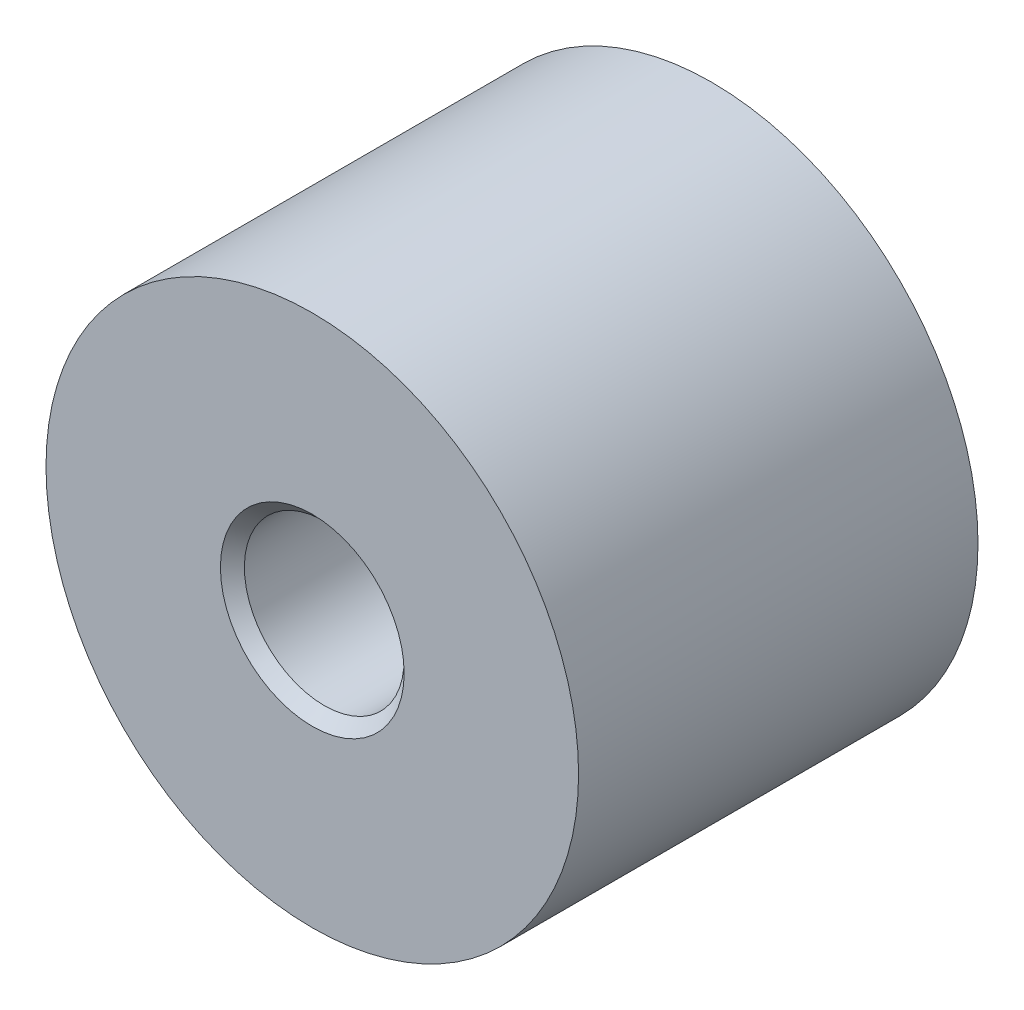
ISO-10303-21;
HEADER;
FILE_DESCRIPTION(('STEP AP214'),'2;1');
FILE_NAME('part.step','',(''),(''),'','','');
FILE_SCHEMA(('AUTOMOTIVE_DESIGN { 1 0 10303 214 1 1 1 1 }'));
ENDSEC;
DATA;
#1=APPLICATION_CONTEXT('core data for automotive mechanical design processes');
#2=APPLICATION_PROTOCOL_DEFINITION('international standard','automotive_design',2000,#1);
#3=PRODUCT_CONTEXT('',#1,'mechanical');
#4=PRODUCT('Part','Part','',(#3));
#5=PRODUCT_RELATED_PRODUCT_CATEGORY('part','',(#4));
#6=PRODUCT_DEFINITION_FORMATION('','',#4);
#7=PRODUCT_DEFINITION_CONTEXT('part definition',#1,'design');
#8=PRODUCT_DEFINITION('design','',#6,#7);
#9=PRODUCT_DEFINITION_SHAPE('','',#8);
#10=(LENGTH_UNIT() NAMED_UNIT(*) SI_UNIT(.MILLI.,.METRE.));
#11=(NAMED_UNIT(*) PLANE_ANGLE_UNIT() SI_UNIT($,.RADIAN.));
#12=(NAMED_UNIT(*) SI_UNIT($,.STERADIAN.) SOLID_ANGLE_UNIT());
#13=UNCERTAINTY_MEASURE_WITH_UNIT(LENGTH_MEASURE(1.E-05),#10,'distance_accuracy_value','');
#14=(GEOMETRIC_REPRESENTATION_CONTEXT(3) GLOBAL_UNCERTAINTY_ASSIGNED_CONTEXT((#13)) GLOBAL_UNIT_ASSIGNED_CONTEXT((#10,
#11,#12)) REPRESENTATION_CONTEXT('',''));
#15=CARTESIAN_POINT('',(0.,0.,0.));
#16=DIRECTION('',(0.,0.,1.));
#17=DIRECTION('',(1.,0.,0.));
#18=AXIS2_PLACEMENT_3D('',#15,#16,#17);
#19=CARTESIAN_POINT('',(9.3333333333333,0.,15.));
#20=DIRECTION('',(0.,0.,1.));
#21=DIRECTION('',(0.,-1.,0.));
#22=AXIS2_PLACEMENT_3D('',#19,#20,#21);
#23=PLANE('',#22);
#24=CARTESIAN_POINT('',(0.,0.,15.));
#25=DIRECTION('',(0.,0.,1.));
#26=DIRECTION('',(0.,-1.,0.));
#27=AXIS2_PLACEMENT_3D('',#24,#25,#26);
#28=CIRCLE('',#27,3.45);
#29=CARTESIAN_POINT('',(0.,-3.45,15.));
#30=VERTEX_POINT('',#29);
#31=EDGE_CURVE('E8',#30,#30,#28,.F.);
#32=ORIENTED_EDGE('',*,*,#31,.T.);
#33=EDGE_LOOP('',(#32));
#34=FACE_BOUND('',#33,.T.);
#35=CARTESIAN_POINT('',(0.,0.,15.));
#36=DIRECTION('',(0.,0.,1.));
#37=DIRECTION('',(0.,-1.,0.));
#38=AXIS2_PLACEMENT_3D('',#35,#36,#37);
#39=CIRCLE('',#38,10.);
#40=CARTESIAN_POINT('',(0.,-10.,15.));
#41=VERTEX_POINT('',#40);
#42=EDGE_CURVE('E32',#41,#41,#39,.T.);
#43=ORIENTED_EDGE('',*,*,#42,.T.);
#44=EDGE_LOOP('',(#43));
#45=FACE_BOUND('',#44,.T.);
#46=ADVANCED_FACE('F12',(#34,#45),#23,.T.);
#47=CARTESIAN_POINT('',(0.,0.,0.5));
#48=DIRECTION('',(0.,0.,1.));
#49=DIRECTION('',(0.,-1.,0.));
#50=AXIS2_PLACEMENT_3D('',#47,#48,#49);
#51=CYLINDRICAL_SURFACE('',#50,10.);
#52=CARTESIAN_POINT('',(0.,0.,0.));
#53=DIRECTION('',(0.,0.,1.));
#54=DIRECTION('',(0.,-1.,0.));
#55=AXIS2_PLACEMENT_3D('',#52,#53,#54);
#56=CIRCLE('',#55,10.);
#57=CARTESIAN_POINT('',(0.,-10.,0.));
#58=VERTEX_POINT('',#57);
#59=EDGE_CURVE('E35',#58,#58,#56,.T.);
#60=ORIENTED_EDGE('',*,*,#59,.T.);
#61=EDGE_LOOP('',(#60));
#62=FACE_BOUND('',#61,.T.);
#63=ORIENTED_EDGE('',*,*,#42,.F.);
#64=EDGE_LOOP('',(#63));
#65=FACE_BOUND('',#64,.T.);
#66=ADVANCED_FACE('F63',(#62,#65),#51,.T.);
#67=CARTESIAN_POINT('',(10.,0.,0.));
#68=DIRECTION('',(0.,0.,-1.));
#69=DIRECTION('',(0.,1.,0.));
#70=AXIS2_PLACEMENT_3D('',#67,#68,#69);
#71=PLANE('',#70);
#72=CARTESIAN_POINT('',(0.,0.,0.));
#73=DIRECTION('',(0.,0.,-1.));
#74=DIRECTION('',(0.,1.,0.));
#75=AXIS2_PLACEMENT_3D('',#72,#73,#74);
#76=CIRCLE('',#75,3.45);
#77=CARTESIAN_POINT('',(0.,3.45,0.));
#78=VERTEX_POINT('',#77);
#79=EDGE_CURVE('E23',#78,#78,#76,.F.);
#80=ORIENTED_EDGE('',*,*,#79,.T.);
#81=EDGE_LOOP('',(#80));
#82=FACE_BOUND('',#81,.T.);
#83=ORIENTED_EDGE('',*,*,#59,.F.);
#84=EDGE_LOOP('',(#83));
#85=FACE_BOUND('',#84,.T.);
#86=ADVANCED_FACE('F68',(#82,#85),#71,.T.);
#87=CARTESIAN_POINT('',(0.,0.,0.));
#88=DIRECTION('',(0.,0.,1.));
#89=DIRECTION('',(0.,-1.,0.));
#90=AXIS2_PLACEMENT_3D('',#87,#88,#89);
#91=CYLINDRICAL_SURFACE('',#90,3.);
#92=CARTESIAN_POINT('',(0.,0.,0.45));
#93=DIRECTION('',(0.,0.,-1.));
#94=DIRECTION('',(0.,1.,0.));
#95=AXIS2_PLACEMENT_3D('',#92,#93,#94);
#96=CIRCLE('',#95,3.);
#97=CARTESIAN_POINT('',(0.,3.,0.45));
#98=VERTEX_POINT('',#97);
#99=EDGE_CURVE('E27',#98,#98,#96,.T.);
#100=ORIENTED_EDGE('',*,*,#99,.T.);
#101=EDGE_LOOP('',(#100));
#102=FACE_BOUND('',#101,.T.);
#103=CARTESIAN_POINT('',(0.,0.,6.));
#104=DIRECTION('',(0.,0.,-1.));
#105=DIRECTION('',(0.,1.,0.));
#106=AXIS2_PLACEMENT_3D('',#103,#104,#105);
#107=CIRCLE('',#106,3.);
#108=CARTESIAN_POINT('',(0.,3.,6.));
#109=VERTEX_POINT('',#108);
#110=EDGE_CURVE('E38',#109,#109,#107,.T.);
#111=ORIENTED_EDGE('',*,*,#110,.F.);
#112=EDGE_LOOP('',(#111));
#113=FACE_BOUND('',#112,.T.);
#114=ADVANCED_FACE('F58',(#102,#113),#91,.F.);
#115=CARTESIAN_POINT('',(0.,0.,6.));
#116=DIRECTION('',(0.,0.,-1.));
#117=DIRECTION('',(0.,1.,0.));
#118=AXIS2_PLACEMENT_3D('',#115,#116,#117);
#119=PLANE('',#118);
#120=ORIENTED_EDGE('',*,*,#110,.T.);
#121=EDGE_LOOP('',(#120));
#122=FACE_BOUND('',#121,.T.);
#123=ADVANCED_FACE('F49',(#122),#119,.T.);
#124=CARTESIAN_POINT('',(0.,0.,11.));
#125=DIRECTION('',(0.,0.,1.));
#126=DIRECTION('',(0.,-1.,0.));
#127=AXIS2_PLACEMENT_3D('',#124,#125,#126);
#128=CYLINDRICAL_SURFACE('',#127,3.);
#129=CARTESIAN_POINT('',(0.,0.,14.55));
#130=DIRECTION('',(0.,0.,1.));
#131=DIRECTION('',(0.,-1.,0.));
#132=AXIS2_PLACEMENT_3D('',#129,#130,#131);
#133=CIRCLE('',#132,3.);
#134=CARTESIAN_POINT('',(0.,-3.,14.55));
#135=VERTEX_POINT('',#134);
#136=EDGE_CURVE('E19',#135,#135,#133,.T.);
#137=ORIENTED_EDGE('',*,*,#136,.T.);
#138=EDGE_LOOP('',(#137));
#139=FACE_BOUND('',#138,.T.);
#140=CARTESIAN_POINT('',(0.,0.,9.));
#141=DIRECTION('',(0.,0.,1.));
#142=DIRECTION('',(0.,-1.,0.));
#143=AXIS2_PLACEMENT_3D('',#140,#141,#142);
#144=CIRCLE('',#143,3.);
#145=CARTESIAN_POINT('',(0.,-3.,9.));
#146=VERTEX_POINT('',#145);
#147=EDGE_CURVE('E41',#146,#146,#144,.T.);
#148=ORIENTED_EDGE('',*,*,#147,.F.);
#149=EDGE_LOOP('',(#148));
#150=FACE_BOUND('',#149,.T.);
#151=ADVANCED_FACE('F47',(#139,#150),#128,.F.);
#152=CARTESIAN_POINT('',(0.,0.,9.));
#153=DIRECTION('',(0.,0.,1.));
#154=DIRECTION('',(0.,-1.,0.));
#155=AXIS2_PLACEMENT_3D('',#152,#153,#154);
#156=PLANE('',#155);
#157=ORIENTED_EDGE('',*,*,#147,.T.);
#158=EDGE_LOOP('',(#157));
#159=FACE_BOUND('',#158,.T.);
#160=ADVANCED_FACE('F45',(#159),#156,.T.);
#161=CARTESIAN_POINT('',(0.,0.,0.45));
#162=DIRECTION('',(0.,0.,-1.));
#163=DIRECTION('',(0.,1.,0.));
#164=AXIS2_PLACEMENT_3D('',#161,#162,#163);
#165=CONICAL_SURFACE('',#164,3.,0.785398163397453);
#166=ORIENTED_EDGE('',*,*,#79,.F.);
#167=EDGE_LOOP('',(#166));
#168=FACE_BOUND('',#167,.T.);
#169=ORIENTED_EDGE('',*,*,#99,.F.);
#170=EDGE_LOOP('',(#169));
#171=FACE_BOUND('',#170,.T.);
#172=ADVANCED_FACE('F56',(#168,#171),#165,.F.);
#173=CARTESIAN_POINT('',(0.,0.,14.55));
#174=DIRECTION('',(0.,0.,1.));
#175=DIRECTION('',(0.,-1.,0.));
#176=AXIS2_PLACEMENT_3D('',#173,#174,#175);
#177=CONICAL_SURFACE('',#176,3.,0.785398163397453);
#178=ORIENTED_EDGE('',*,*,#31,.F.);
#179=EDGE_LOOP('',(#178));
#180=FACE_BOUND('',#179,.T.);
#181=ORIENTED_EDGE('',*,*,#136,.F.);
#182=EDGE_LOOP('',(#181));
#183=FACE_BOUND('',#182,.T.);
#184=ADVANCED_FACE('F14',(#180,#183),#177,.F.);
#185=CLOSED_SHELL('',(#46,#66,#86,#114,#123,#151,#160,#172,#184));
#186=MANIFOLD_SOLID_BREP('B1',#185);
#187=ADVANCED_BREP_SHAPE_REPRESENTATION('',(#18,#186),#14);
#188=SHAPE_DEFINITION_REPRESENTATION(#9,#187);
ENDSEC;
END-ISO-10303-21;
